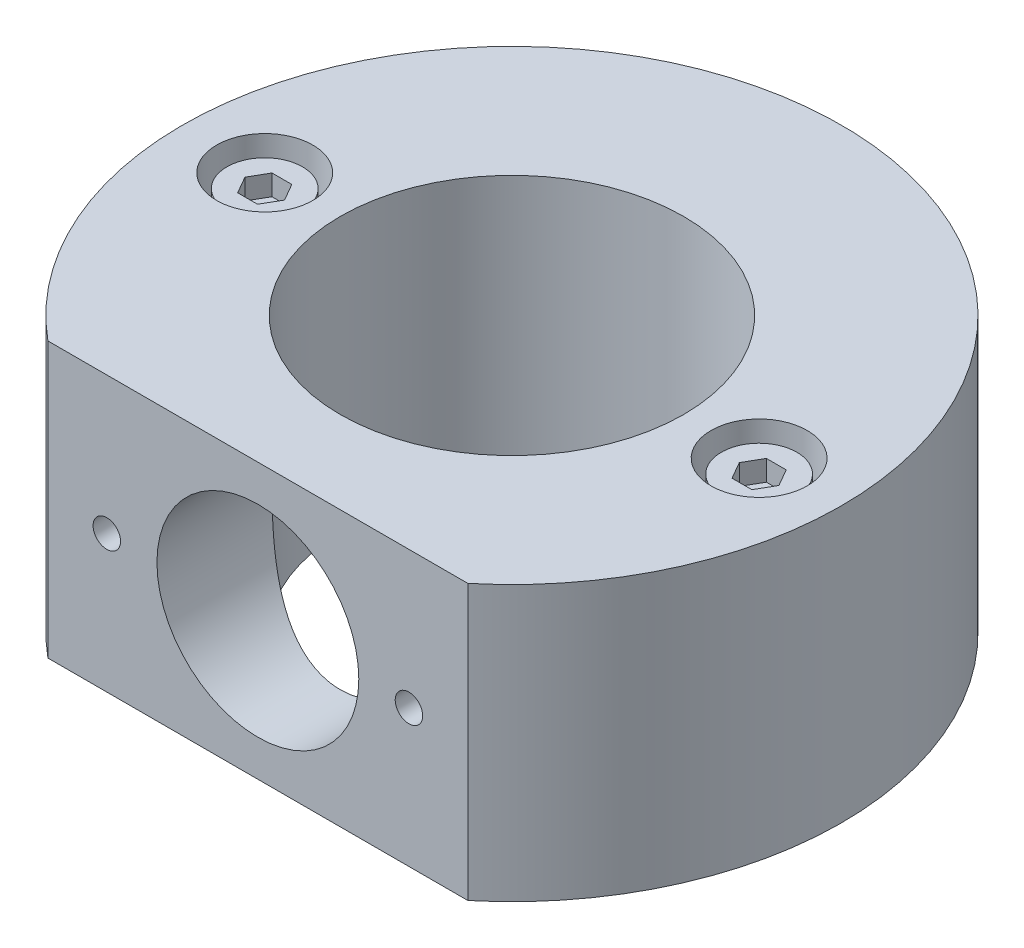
ISO-10303-21;
HEADER;
FILE_DESCRIPTION(('STEP AP214'),'2;1');
FILE_NAME('part.step','',(''),(''),'','','');
FILE_SCHEMA(('AUTOMOTIVE_DESIGN { 1 0 10303 214 1 1 1 1 }'));
ENDSEC;
DATA;
#1=APPLICATION_CONTEXT('core data for automotive mechanical design processes');
#2=APPLICATION_PROTOCOL_DEFINITION('international standard','automotive_design',2000,#1);
#3=PRODUCT_CONTEXT('',#1,'mechanical');
#4=PRODUCT('Part','Part','',(#3));
#5=PRODUCT_RELATED_PRODUCT_CATEGORY('part','',(#4));
#6=PRODUCT_DEFINITION_FORMATION('','',#4);
#7=PRODUCT_DEFINITION_CONTEXT('part definition',#1,'design');
#8=PRODUCT_DEFINITION('design','',#6,#7);
#9=PRODUCT_DEFINITION_SHAPE('','',#8);
#10=(LENGTH_UNIT() NAMED_UNIT(*) SI_UNIT(.MILLI.,.METRE.));
#11=(NAMED_UNIT(*) PLANE_ANGLE_UNIT() SI_UNIT($,.RADIAN.));
#12=(NAMED_UNIT(*) SI_UNIT($,.STERADIAN.) SOLID_ANGLE_UNIT());
#13=UNCERTAINTY_MEASURE_WITH_UNIT(LENGTH_MEASURE(1.E-05),#10,'distance_accuracy_value','');
#14=(GEOMETRIC_REPRESENTATION_CONTEXT(3) GLOBAL_UNCERTAINTY_ASSIGNED_CONTEXT((#13)) GLOBAL_UNIT_ASSIGNED_CONTEXT((#10,
#11,#12)) REPRESENTATION_CONTEXT('',''));
#15=CARTESIAN_POINT('',(0.,0.,0.));
#16=DIRECTION('',(0.,0.,1.));
#17=DIRECTION('',(1.,0.,0.));
#18=AXIS2_PLACEMENT_3D('',#15,#16,#17);
#19=CARTESIAN_POINT('',(-1.39659253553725E-13,20.,0.));
#20=DIRECTION('',(0.,-1.,0.));
#21=DIRECTION('',(1.,0.,0.));
#22=AXIS2_PLACEMENT_3D('',#19,#20,#21);
#23=CYLINDRICAL_SURFACE('',#22,12.5);
#24=CARTESIAN_POINT('',(0.,0.,0.));
#25=DIRECTION('',(0.,-1.,0.));
#26=DIRECTION('',(1.,0.,0.));
#27=AXIS2_PLACEMENT_3D('',#24,#25,#26);
#28=CIRCLE('',#27,12.5);
#29=CARTESIAN_POINT('',(12.5,0.,0.));
#30=VERTEX_POINT('',#29);
#31=EDGE_CURVE('E266',#30,#30,#28,.T.);
#32=ORIENTED_EDGE('',*,*,#31,.T.);
#33=EDGE_LOOP('',(#32));
#34=FACE_BOUND('',#33,.T.);
#35=CARTESIAN_POINT('',(0.,2.65000000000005,12.5));
#36=CARTESIAN_POINT('',(0.188687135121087,2.65000145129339,12.4999986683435));
#37=CARTESIAN_POINT('',(0.37743978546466,2.657277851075,12.4957163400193));
#38=CARTESIAN_POINT('',(0.753530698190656,2.68629332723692,12.4786886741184));
#39=CARTESIAN_POINT('',(0.940867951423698,2.70804188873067,12.4659377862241));
#40=CARTESIAN_POINT('',(1.31300012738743,2.76577214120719,12.4322565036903));
#41=CARTESIAN_POINT('',(1.49778885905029,2.80178373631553,12.4113089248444));
#42=CARTESIAN_POINT('',(1.8631561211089,2.88758913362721,12.3617419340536));
#43=CARTESIAN_POINT('',(2.04373280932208,2.9373888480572,12.333119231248));
#44=CARTESIAN_POINT('',(2.39847109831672,3.04987317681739,12.2690519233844));
#45=CARTESIAN_POINT('',(2.57266217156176,3.11248646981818,12.2336451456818));
#46=CARTESIAN_POINT('',(2.91470298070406,3.25010821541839,12.1566976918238));
#47=CARTESIAN_POINT('',(3.08255023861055,3.32512145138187,12.1151546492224));
#48=CARTESIAN_POINT('',(3.57501678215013,3.56762837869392,11.9826734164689));
#49=CARTESIAN_POINT('',(3.88903345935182,3.75274114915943,11.8837941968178));
#50=CARTESIAN_POINT('',(4.5054233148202,4.17978724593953,11.6647448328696));
#51=CARTESIAN_POINT('',(4.80517136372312,4.42493367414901,11.5435356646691));
#52=CARTESIAN_POINT('',(5.36201152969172,4.9581745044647,11.2956497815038));
#53=CARTESIAN_POINT('',(5.61904943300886,5.24632262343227,11.1689663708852));
#54=CARTESIAN_POINT('',(5.98273049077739,5.72496735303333,10.9762838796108));
#55=CARTESIAN_POINT('',(6.10569416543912,5.90245906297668,10.9081702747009));
#56=CARTESIAN_POINT('',(6.33616392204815,6.26873724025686,10.7759291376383));
#57=CARTESIAN_POINT('',(6.4436676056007,6.45752545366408,10.7118022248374));
#58=CARTESIAN_POINT('',(6.64209900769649,6.84525779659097,10.589904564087));
#59=CARTESIAN_POINT('',(6.7330479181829,7.04418851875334,10.5321257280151));
#60=CARTESIAN_POINT('',(6.89746900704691,7.45135797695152,10.4251882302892));
#61=CARTESIAN_POINT('',(6.97094737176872,7.65959338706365,10.3760265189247));
#62=CARTESIAN_POINT('',(7.0843561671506,8.03446871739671,10.2988077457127));
#63=CARTESIAN_POINT('',(7.12811421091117,8.19949640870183,10.2685022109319));
#64=CARTESIAN_POINT('',(7.20420972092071,8.53331967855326,10.2152594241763));
#65=CARTESIAN_POINT('',(7.2365496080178,8.70211445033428,10.1923206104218));
#66=CARTESIAN_POINT('',(7.28936834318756,9.04229079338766,10.1546130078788));
#67=CARTESIAN_POINT('',(7.30985864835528,9.21366970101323,10.1398363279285));
#68=CARTESIAN_POINT('',(7.33873028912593,9.55798094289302,10.1189603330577));
#69=CARTESIAN_POINT('',(7.34711140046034,9.73091330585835,10.1128611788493));
#70=CARTESIAN_POINT('',(7.35163767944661,10.0773171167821,10.1095713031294));
#71=CARTESIAN_POINT('',(7.34776210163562,10.2507889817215,10.1123956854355));
#72=CARTESIAN_POINT('',(7.32779047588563,10.5966521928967,10.1268769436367));
#73=CARTESIAN_POINT('',(7.31169437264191,10.7690435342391,10.138533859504));
#74=CARTESIAN_POINT('',(7.26751374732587,11.1115655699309,10.1702497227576));
#75=CARTESIAN_POINT('',(7.23942410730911,11.2816952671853,10.1903122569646));
#76=CARTESIAN_POINT('',(7.17162745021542,11.6185793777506,10.2381383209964));
#77=CARTESIAN_POINT('',(7.13191570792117,11.7853323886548,10.2659049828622));
#78=CARTESIAN_POINT('',(7.04177510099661,12.1129353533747,10.3279409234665));
#79=CARTESIAN_POINT('',(6.99144988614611,12.2738259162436,10.3621469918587));
#80=CARTESIAN_POINT('',(6.88035567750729,12.5906381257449,10.4362426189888));
#81=CARTESIAN_POINT('',(6.81958326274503,12.7465581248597,10.476134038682));
#82=CARTESIAN_POINT('',(6.62235706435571,13.2059159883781,10.6027737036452));
#83=CARTESIAN_POINT('',(6.47094919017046,13.5011134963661,10.6965197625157));
#84=CARTESIAN_POINT('',(6.10314538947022,14.1136916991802,10.9111915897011));
#85=CARTESIAN_POINT('',(5.88009380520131,14.4264068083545,11.0340342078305));
#86=CARTESIAN_POINT('',(5.51176820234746,14.8661642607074,11.2200472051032));
#87=CARTESIAN_POINT('',(5.38325760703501,15.0079609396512,11.2823911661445));
#88=CARTESIAN_POINT('',(5.11534440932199,15.2813225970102,11.4063583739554));
#89=CARTESIAN_POINT('',(4.97593991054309,15.4128857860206,11.4679814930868));
#90=CARTESIAN_POINT('',(4.66815520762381,15.6813487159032,11.5969667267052));
#91=CARTESIAN_POINT('',(4.49835426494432,15.8167586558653,11.6640476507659));
#92=CARTESIAN_POINT('',(4.14637317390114,16.0726773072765,11.7937588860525));
#93=CARTESIAN_POINT('',(3.96419797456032,16.1931919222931,11.8563909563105));
#94=CARTESIAN_POINT('',(3.58835823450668,16.4182669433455,11.9754972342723));
#95=CARTESIAN_POINT('',(3.39469559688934,16.5228299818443,12.0319724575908));
#96=CARTESIAN_POINT('',(2.99703717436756,16.7148341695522,12.1371349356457));
#97=CARTESIAN_POINT('',(2.793042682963,16.8022774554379,12.1858231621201));
#98=CARTESIAN_POINT('',(2.38996605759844,16.9536898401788,12.2710085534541));
#99=CARTESIAN_POINT('',(2.19144852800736,17.0188274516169,12.308098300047));
#100=CARTESIAN_POINT('',(1.78817440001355,17.1322361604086,12.3731213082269));
#101=CARTESIAN_POINT('',(1.58341800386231,17.1805078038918,12.4010548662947));
#102=CARTESIAN_POINT('',(1.16961672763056,17.2593952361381,12.4468987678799));
#103=CARTESIAN_POINT('',(0.960575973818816,17.290027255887,12.464818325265));
#104=CARTESIAN_POINT('',(0.540008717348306,17.3331818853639,12.4901059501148));
#105=CARTESIAN_POINT('',(0.328482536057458,17.3457068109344,12.4974753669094));
#106=CARTESIAN_POINT('',(-0.0674330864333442,17.3520006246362,12.5011766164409));
#107=CARTESIAN_POINT('',(-0.251779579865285,17.3479938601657,12.4988174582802));
#108=CARTESIAN_POINT('',(-0.619370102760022,17.3261704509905,12.4859998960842));
#109=CARTESIAN_POINT('',(-0.802614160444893,17.3083541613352,12.4755417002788));
#110=CARTESIAN_POINT('',(-1.16662778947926,17.2591468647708,12.4467793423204));
#111=CARTESIAN_POINT('',(-1.3473975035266,17.2277566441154,12.4284756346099));
#112=CARTESIAN_POINT('',(-1.70522100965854,17.1517955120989,12.3844548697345));
#113=CARTESIAN_POINT('',(-1.88227469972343,17.1072242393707,12.3587376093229));
#114=CARTESIAN_POINT('',(-2.22833866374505,17.0063461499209,12.3010042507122));
#115=CARTESIAN_POINT('',(-2.39743690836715,16.9502696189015,12.2691123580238));
#116=CARTESIAN_POINT('',(-2.73007749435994,16.8264715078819,12.1994101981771));
#117=CARTESIAN_POINT('',(-2.89361799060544,16.7587461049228,12.1615979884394));
#118=CARTESIAN_POINT('',(-3.37460731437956,16.5390061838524,12.0403933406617));
#119=CARTESIAN_POINT('',(-3.68267291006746,16.3703544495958,11.9491897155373));
#120=CARTESIAN_POINT('',(-4.29899241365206,15.9740528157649,11.7424565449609));
#121=CARTESIAN_POINT('',(-4.6039179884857,15.7420853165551,11.6253822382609));
#122=CARTESIAN_POINT('',(-5.17302246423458,15.2352292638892,11.3835602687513));
#123=CARTESIAN_POINT('',(-5.43715314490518,14.9602906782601,11.2588037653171));
#124=CARTESIAN_POINT('',(-5.81429221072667,14.5013539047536,11.0664942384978));
#125=CARTESIAN_POINT('',(-5.94280069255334,14.3303057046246,10.9978325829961));
#126=CARTESIAN_POINT('',(-6.18495531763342,13.9767716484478,10.8634924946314));
#127=CARTESIAN_POINT('',(-6.29859916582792,13.7942840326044,10.7978145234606));
#128=CARTESIAN_POINT('',(-6.51001451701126,13.4188578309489,10.6716851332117));
#129=CARTESIAN_POINT('',(-6.60780085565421,13.2259292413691,10.6112288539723));
#130=CARTESIAN_POINT('',(-6.78663914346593,12.8303878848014,10.4977497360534));
#131=CARTESIAN_POINT('',(-6.86769648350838,12.6277782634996,10.4447245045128));
#132=CARTESIAN_POINT('',(-6.99643516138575,12.2587422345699,10.358789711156));
#133=CARTESIAN_POINT('',(-7.0475442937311,12.0939408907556,10.324008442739));
#134=CARTESIAN_POINT('',(-7.13826833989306,11.7599817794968,10.2614893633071));
#135=CARTESIAN_POINT('',(-7.17789024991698,11.590826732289,10.2337472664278));
#136=CARTESIAN_POINT('',(-7.24515709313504,11.249191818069,10.1862357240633));
#137=CARTESIAN_POINT('',(-7.27281231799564,11.0767149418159,10.1664594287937));
#138=CARTESIAN_POINT('',(-7.31580523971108,10.7294516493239,10.1355660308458));
#139=CARTESIAN_POINT('',(-7.33114281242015,10.5546652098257,10.1244490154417));
#140=CARTESIAN_POINT('',(-7.3492890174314,10.2035706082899,10.1112847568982));
#141=CARTESIAN_POINT('',(-7.35205990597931,10.027259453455,10.109264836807));
#142=CARTESIAN_POINT('',(-7.34492513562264,9.67503148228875,10.1144497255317));
#143=CARTESIAN_POINT('',(-7.33501943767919,9.49911466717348,10.1216545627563));
#144=CARTESIAN_POINT('',(-7.30268112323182,9.14895253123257,10.1450107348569));
#145=CARTESIAN_POINT('',(-7.28024205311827,8.97470811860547,10.161166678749));
#146=CARTESIAN_POINT('',(-7.22316722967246,8.62922861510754,10.2018173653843));
#147=CARTESIAN_POINT('',(-7.18853134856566,8.45799355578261,10.226312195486));
#148=CARTESIAN_POINT('',(-7.10892963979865,8.12548105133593,10.2817987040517));
#149=CARTESIAN_POINT('',(-7.0643648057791,7.9640643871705,10.3125349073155));
#150=CARTESIAN_POINT('',(-6.9647630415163,7.64576797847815,10.3800621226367));
#151=CARTESIAN_POINT('',(-6.9097225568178,7.4888897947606,10.4168551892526));
#152=CARTESIAN_POINT('',(-6.7296317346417,7.02610005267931,10.5348318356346));
#153=CARTESIAN_POINT('',(-6.5895709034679,6.72786417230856,10.6236428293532));
#154=CARTESIAN_POINT('',(-6.24849643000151,6.11136647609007,10.8282753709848));
#155=CARTESIAN_POINT('',(-6.04140226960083,5.79715665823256,10.9461499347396));
#156=CARTESIAN_POINT('',(-5.69778432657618,5.35318958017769,11.1266392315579));
#157=CARTESIAN_POINT('',(-5.57765462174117,5.20966895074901,11.1874584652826));
#158=CARTESIAN_POINT('',(-5.32675106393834,4.93213970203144,11.3090731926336));
#159=CARTESIAN_POINT('',(-5.19597550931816,4.79813260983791,11.3698686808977));
#160=CARTESIAN_POINT('',(-4.904283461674,4.5212528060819,11.4990019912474));
#161=CARTESIAN_POINT('',(-4.74176190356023,4.37997159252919,11.5671351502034));
#162=CARTESIAN_POINT('',(-4.40410499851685,4.11163500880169,11.6998611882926));
#163=CARTESIAN_POINT('',(-4.22897380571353,3.98457498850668,11.7644552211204));
#164=CARTESIAN_POINT('',(-3.86674763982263,3.74557194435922,11.8884366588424));
#165=CARTESIAN_POINT('',(-3.67964507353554,3.633638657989,11.9478207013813));
#166=CARTESIAN_POINT('',(-3.29461831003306,3.42612756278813,12.0596708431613));
#167=CARTESIAN_POINT('',(-3.09669566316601,3.33054741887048,12.1121379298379));
#168=CARTESIAN_POINT('',(-2.70000728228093,3.16062863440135,12.206544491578));
#169=CARTESIAN_POINT('',(-2.50164144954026,3.08555502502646,12.2488388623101));
#170=CARTESIAN_POINT('',(-2.09762174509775,2.95246882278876,12.3244551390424));
#171=CARTESIAN_POINT('',(-1.89196925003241,2.89445302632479,12.3577787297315));
#172=CARTESIAN_POINT('',(-1.47575528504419,2.79651374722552,12.4143514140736));
#173=CARTESIAN_POINT('',(-1.26521176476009,2.75653257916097,12.4376326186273));
#174=CARTESIAN_POINT('',(-0.840662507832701,2.69508972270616,12.473515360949));
#175=CARTESIAN_POINT('',(-0.626659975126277,2.67361179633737,12.486126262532));
#176=CARTESIAN_POINT('',(-0.343464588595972,2.65770728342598,12.4954695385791));
#177=CARTESIAN_POINT('',(-0.27481817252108,2.65481810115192,12.4971674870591));
#178=CARTESIAN_POINT('',(-0.137450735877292,2.65096418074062,12.4994329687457));
#179=CARTESIAN_POINT('',(-0.0687297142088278,2.64999947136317,12.5000004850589));
#180=CARTESIAN_POINT('',(0.,2.65000000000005,12.5));
#181=B_SPLINE_CURVE_WITH_KNOTS('',3,(#35,#36,#37,#38,#39,#40,#41,#42,#43,#44,#45,#46,#47,#48,
#49,#50,#51,#52,#53,#54,#55,#56,#57,#58,#59,#60,#61,#62,#63,#64,#65,#66,#67,#68,#69,#70,#71,#72,
#73,#74,#75,#76,#77,#78,#79,#80,#81,#82,#83,#84,#85,#86,#87,#88,#89,#90,#91,#92,#93,#94,#95,#96,
#97,#98,#99,#100,#101,#102,#103,#104,#105,#106,#107,#108,#109,#110,#111,#112,#113,#114,#115,
#116,#117,#118,#119,#120,#121,#122,#123,#124,#125,#126,#127,#128,#129,#130,#131,#132,#133,#134,
#135,#136,#137,#138,#139,#140,#141,#142,#143,#144,#145,#146,#147,#148,#149,#150,#151,#152,#153,
#154,#155,#156,#157,#158,#159,#160,#161,#162,#163,#164,#165,#166,#167,#168,#169,#170,#171,#172,
#173,#174,#175,#176,#177,#178,#179,#180),.UNSPECIFIED.,.T.,.F.,(4,2,2,2,2,2,2,2,2,2,2,2,2,2,2,2,
2,2,2,2,2,2,2,2,2,2,2,2,2,2,2,2,2,2,2,2,2,2,2,2,2,2,2,2,2,2,2,2,2,2,2,2,2,2,2,2,2,2,2,2,2,2,2,2,
2,2,2,2,2,2,2,2,4),(0.,0.565987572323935,1.13234646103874,1.69989912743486,2.26769553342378,
2.83241354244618,3.39734990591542,4.52572664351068,5.73845320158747,6.95270755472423,
7.63124396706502,8.30988553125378,8.9876521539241,9.66517841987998,10.1848522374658,
10.7044158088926,11.2234761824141,11.7425461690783,12.2624951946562,12.7824465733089,
13.3026200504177,13.8230053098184,14.3385261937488,14.8542162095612,15.8850880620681,
17.0899566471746,17.6933100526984,18.2967687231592,18.9778384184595,19.6586373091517,
20.3393237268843,21.0199251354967,21.6556000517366,22.2912543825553,22.9263228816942,
23.5613101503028,24.1138419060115,24.6663594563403,25.2188450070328,25.7713457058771,
26.3137108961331,26.8562544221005,27.9405605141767,29.1379036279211,30.3366513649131,
31.0100553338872,31.6835631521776,32.356437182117,33.0290940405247,33.5566185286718,
34.0838210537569,34.6105692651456,35.1373227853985,35.6656573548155,36.1939935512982,
36.7226020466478,37.2512160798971,37.7614523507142,38.2718620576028,39.2921568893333,
40.4704691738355,41.0604398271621,41.6505049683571,42.3272900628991,43.00385320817,
43.6808498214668,44.3577496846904,45.0056305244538,45.6533896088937,46.2990618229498,
46.9441668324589,47.1503260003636,47.356488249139),.UNSPECIFIED.);
#182=CARTESIAN_POINT('',(0.,2.65000000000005,12.5));
#183=VERTEX_POINT('',#182);
#184=EDGE_CURVE('E19',#183,#183,#181,.T.);
#185=ORIENTED_EDGE('',*,*,#184,.T.);
#186=EDGE_LOOP('',(#185));
#187=FACE_BOUND('',#186,.T.);
#188=CARTESIAN_POINT('',(-1.39659253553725E-13,20.,0.));
#189=DIRECTION('',(0.,1.,0.));
#190=DIRECTION('',(-1.,0.,0.));
#191=AXIS2_PLACEMENT_3D('',#188,#189,#190);
#192=CIRCLE('',#191,12.5);
#193=CARTESIAN_POINT('',(-12.5000000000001,19.9999999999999,0.));
#194=VERTEX_POINT('',#193);
#195=EDGE_CURVE('E288',#194,#194,#192,.T.);
#196=ORIENTED_EDGE('',*,*,#195,.T.);
#197=EDGE_LOOP('',(#196));
#198=FACE_BOUND('',#197,.T.);
#199=ADVANCED_FACE('F15',(#34,#187,#198),#23,.F.);
#200=CARTESIAN_POINT('',(-1.39659253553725E-13,20.,0.));
#201=DIRECTION('',(0.,1.,0.));
#202=DIRECTION('',(-1.,0.,0.));
#203=AXIS2_PLACEMENT_3D('',#200,#201,#202);
#204=PLANE('',#203);
#205=CARTESIAN_POINT('',(18.,20.,0.));
#206=DIRECTION('',(0.,1.,0.));
#207=DIRECTION('',(-1.,0.,0.));
#208=AXIS2_PLACEMENT_3D('',#205,#206,#207);
#209=CIRCLE('',#208,3.5);
#210=CARTESIAN_POINT('',(14.5,20.,0.));
#211=VERTEX_POINT('',#210);
#212=EDGE_CURVE('E291',#211,#211,#209,.T.);
#213=ORIENTED_EDGE('',*,*,#212,.F.);
#214=EDGE_LOOP('',(#213));
#215=FACE_BOUND('',#214,.T.);
#216=ORIENTED_EDGE('',*,*,#195,.F.);
#217=EDGE_LOOP('',(#216));
#218=FACE_BOUND('',#217,.T.);
#219=CARTESIAN_POINT('',(-18.,20.,0.));
#220=DIRECTION('',(0.,1.,0.));
#221=DIRECTION('',(-1.,0.,0.));
#222=AXIS2_PLACEMENT_3D('',#219,#220,#221);
#223=CIRCLE('',#222,3.5);
#224=CARTESIAN_POINT('',(-21.5,20.,0.));
#225=VERTEX_POINT('',#224);
#226=EDGE_CURVE('E285',#225,#225,#223,.T.);
#227=ORIENTED_EDGE('',*,*,#226,.F.);
#228=EDGE_LOOP('',(#227));
#229=FACE_BOUND('',#228,.T.);
#230=DIRECTION('',(-1.,0.,0.));
#231=VECTOR('',#230,1.);
#232=CARTESIAN_POINT('',(-1.39659253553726E-13,20.,18.5));
#233=LINE('',#232,#231);
#234=CARTESIAN_POINT('',(15.2888848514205,20.,18.5));
#235=VERTEX_POINT('',#234);
#236=CARTESIAN_POINT('',(-15.2888848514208,20.,18.5));
#237=VERTEX_POINT('',#236);
#238=EDGE_CURVE('E280',#235,#237,#233,.T.);
#239=ORIENTED_EDGE('',*,*,#238,.F.);
#240=CARTESIAN_POINT('',(-1.39659253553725E-13,20.,0.));
#241=DIRECTION('',(0.,1.,0.));
#242=DIRECTION('',(-1.,0.,0.));
#243=AXIS2_PLACEMENT_3D('',#240,#241,#242);
#244=CIRCLE('',#243,24.);
#245=EDGE_CURVE('E282',#235,#237,#244,.T.);
#246=ORIENTED_EDGE('',*,*,#245,.T.);
#247=EDGE_LOOP('',(#239,#246));
#248=FACE_BOUND('',#247,.T.);
#249=ADVANCED_FACE('F322',(#215,#218,#229,#248),#204,.T.);
#250=CARTESIAN_POINT('',(0.,0.,0.));
#251=DIRECTION('',(0.,1.,0.));
#252=DIRECTION('',(-1.,0.,0.));
#253=AXIS2_PLACEMENT_3D('',#250,#251,#252);
#254=PLANE('',#253);
#255=DIRECTION('',(1.,0.,0.));
#256=VECTOR('',#255,1.);
#257=CARTESIAN_POINT('',(0.,0.,18.5));
#258=LINE('',#257,#256);
#259=CARTESIAN_POINT('',(-15.2888848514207,0.,18.5));
#260=VERTEX_POINT('',#259);
#261=CARTESIAN_POINT('',(15.2888848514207,1.71354117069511E-13,18.5));
#262=VERTEX_POINT('',#261);
#263=EDGE_CURVE('E275',#260,#262,#258,.T.);
#264=ORIENTED_EDGE('',*,*,#263,.F.);
#265=CARTESIAN_POINT('',(0.,0.,0.));
#266=DIRECTION('',(0.,-1.,0.));
#267=DIRECTION('',(1.,0.,0.));
#268=AXIS2_PLACEMENT_3D('',#265,#266,#267);
#269=CIRCLE('',#268,24.);
#270=EDGE_CURVE('E277',#260,#262,#269,.T.);
#271=ORIENTED_EDGE('',*,*,#270,.T.);
#272=EDGE_LOOP('',(#264,#271));
#273=FACE_BOUND('',#272,.T.);
#274=CARTESIAN_POINT('',(-18.,-1.25693328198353E-13,0.));
#275=DIRECTION('',(0.,-1.,0.));
#276=DIRECTION('',(1.,0.,0.));
#277=AXIS2_PLACEMENT_3D('',#274,#275,#276);
#278=CIRCLE('',#277,1.75);
#279=CARTESIAN_POINT('',(-16.25,-1.13473143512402E-13,0.));
#280=VERTEX_POINT('',#279);
#281=EDGE_CURVE('E272',#280,#280,#278,.T.);
#282=ORIENTED_EDGE('',*,*,#281,.F.);
#283=EDGE_LOOP('',(#282));
#284=FACE_BOUND('',#283,.T.);
#285=CARTESIAN_POINT('',(18.,1.25693328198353E-13,0.));
#286=DIRECTION('',(0.,-1.,0.));
#287=DIRECTION('',(1.,0.,0.));
#288=AXIS2_PLACEMENT_3D('',#285,#286,#287);
#289=CIRCLE('',#288,1.75);
#290=CARTESIAN_POINT('',(19.75,1.37913512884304E-13,0.));
#291=VERTEX_POINT('',#290);
#292=EDGE_CURVE('E269',#291,#291,#289,.T.);
#293=ORIENTED_EDGE('',*,*,#292,.F.);
#294=EDGE_LOOP('',(#293));
#295=FACE_BOUND('',#294,.T.);
#296=ORIENTED_EDGE('',*,*,#31,.F.);
#297=EDGE_LOOP('',(#296));
#298=FACE_BOUND('',#297,.T.);
#299=ADVANCED_FACE('F328',(#273,#284,#295,#298),#254,.F.);
#300=CARTESIAN_POINT('',(-1.39659253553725E-13,20.,0.));
#301=DIRECTION('',(0.,-1.,0.));
#302=DIRECTION('',(1.,0.,0.));
#303=AXIS2_PLACEMENT_3D('',#300,#301,#302);
#304=CYLINDRICAL_SURFACE('',#303,24.);
#305=ORIENTED_EDGE('',*,*,#270,.F.);
#306=DIRECTION('',(0.,-1.,0.));
#307=VECTOR('',#306,1.);
#308=CARTESIAN_POINT('',(-15.2888848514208,20.,18.5));
#309=LINE('',#308,#307);
#310=EDGE_CURVE('E10',#237,#260,#309,.T.);
#311=ORIENTED_EDGE('',*,*,#310,.F.);
#312=ORIENTED_EDGE('',*,*,#245,.F.);
#313=DIRECTION('',(0.,-1.,0.));
#314=VECTOR('',#313,1.);
#315=CARTESIAN_POINT('',(15.2888848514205,20.,18.5));
#316=LINE('',#315,#314);
#317=EDGE_CURVE('E29',#235,#262,#316,.T.);
#318=ORIENTED_EDGE('',*,*,#317,.T.);
#319=EDGE_LOOP('',(#305,#311,#312,#318));
#320=FACE_BOUND('',#319,.T.);
#321=ADVANCED_FACE('F17',(#320),#304,.T.);
#322=CARTESIAN_POINT('',(15.2888848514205,20.,18.5));
#323=DIRECTION('',(0.,0.,-1.));
#324=DIRECTION('',(0.,-1.,0.));
#325=AXIS2_PLACEMENT_3D('',#322,#323,#324);
#326=PLANE('',#325);
#327=CARTESIAN_POINT('',(-11.,10.,18.5));
#328=DIRECTION('',(0.,0.,1.));
#329=DIRECTION('',(0.,1.,0.));
#330=AXIS2_PLACEMENT_3D('',#327,#328,#329);
#331=CIRCLE('',#330,1.);
#332=CARTESIAN_POINT('',(-11.,11.,18.5));
#333=VERTEX_POINT('',#332);
#334=EDGE_CURVE('E251',#333,#333,#331,.T.);
#335=ORIENTED_EDGE('',*,*,#334,.F.);
#336=EDGE_LOOP('',(#335));
#337=FACE_BOUND('',#336,.T.);
#338=CARTESIAN_POINT('',(11.,10.0000000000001,18.5));
#339=DIRECTION('',(0.,0.,1.));
#340=DIRECTION('',(0.,1.,0.));
#341=AXIS2_PLACEMENT_3D('',#338,#339,#340);
#342=CIRCLE('',#341,1.);
#343=CARTESIAN_POINT('',(11.,11.0000000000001,18.5));
#344=VERTEX_POINT('',#343);
#345=EDGE_CURVE('E255',#344,#344,#342,.T.);
#346=ORIENTED_EDGE('',*,*,#345,.F.);
#347=EDGE_LOOP('',(#346));
#348=FACE_BOUND('',#347,.T.);
#349=ORIENTED_EDGE('',*,*,#263,.T.);
#350=ORIENTED_EDGE('',*,*,#317,.F.);
#351=ORIENTED_EDGE('',*,*,#238,.T.);
#352=ORIENTED_EDGE('',*,*,#310,.T.);
#353=EDGE_LOOP('',(#349,#350,#351,#352));
#354=FACE_BOUND('',#353,.T.);
#355=CARTESIAN_POINT('',(0.,10.,18.5));
#356=DIRECTION('',(0.,0.,1.));
#357=DIRECTION('',(0.,1.,0.));
#358=AXIS2_PLACEMENT_3D('',#355,#356,#357);
#359=CIRCLE('',#358,7.35);
#360=CARTESIAN_POINT('',(-1.21154402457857E-13,17.35,18.5));
#361=VERTEX_POINT('',#360);
#362=EDGE_CURVE('E261',#361,#361,#359,.T.);
#363=ORIENTED_EDGE('',*,*,#362,.F.);
#364=EDGE_LOOP('',(#363));
#365=FACE_BOUND('',#364,.T.);
#366=ADVANCED_FACE('F308',(#337,#348,#354,#365),#326,.F.);
#367=CARTESIAN_POINT('',(0.,10.,18.5));
#368=DIRECTION('',(0.,0.,-1.));
#369=DIRECTION('',(0.,-1.,0.));
#370=AXIS2_PLACEMENT_3D('',#367,#368,#369);
#371=CYLINDRICAL_SURFACE('',#370,7.35);
#372=ORIENTED_EDGE('',*,*,#362,.T.);
#373=EDGE_LOOP('',(#372));
#374=FACE_BOUND('',#373,.T.);
#375=ORIENTED_EDGE('',*,*,#184,.F.);
#376=EDGE_LOOP('',(#375));
#377=FACE_BOUND('',#376,.T.);
#378=ADVANCED_FACE('F305',(#374,#377),#371,.F.);
#379=CARTESIAN_POINT('',(18.,20.,0.));
#380=DIRECTION('',(0.,1.,0.));
#381=DIRECTION('',(-1.,0.,0.));
#382=AXIS2_PLACEMENT_3D('',#379,#380,#381);
#383=CYLINDRICAL_SURFACE('',#382,1.75);
#384=CARTESIAN_POINT('',(18.,16.,0.));
#385=DIRECTION('',(0.,-1.,0.));
#386=DIRECTION('',(1.,0.,0.));
#387=AXIS2_PLACEMENT_3D('',#384,#385,#386);
#388=CIRCLE('',#387,1.75);
#389=CARTESIAN_POINT('',(19.75,16.,0.));
#390=VERTEX_POINT('',#389);
#391=EDGE_CURVE('E248',#390,#390,#388,.F.);
#392=ORIENTED_EDGE('',*,*,#391,.T.);
#393=EDGE_LOOP('',(#392));
#394=FACE_BOUND('',#393,.T.);
#395=ORIENTED_EDGE('',*,*,#292,.T.);
#396=EDGE_LOOP('',(#395));
#397=FACE_BOUND('',#396,.T.);
#398=ADVANCED_FACE('F307',(#394,#397),#383,.F.);
#399=CARTESIAN_POINT('',(14.5,16.,0.));
#400=DIRECTION('',(0.,-1.,0.));
#401=DIRECTION('',(1.,0.,0.));
#402=AXIS2_PLACEMENT_3D('',#399,#400,#401);
#403=PLANE('',#402);
#404=CARTESIAN_POINT('',(18.,16.,0.));
#405=DIRECTION('',(0.,1.,0.));
#406=DIRECTION('',(-0.866025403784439,0.,-0.5));
#407=AXIS2_PLACEMENT_3D('',#404,#405,#406);
#408=CIRCLE('',#407,2.75);
#409=CARTESIAN_POINT('',(15.6184301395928,16.,-1.37500000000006));
#410=VERTEX_POINT('',#409);
#411=EDGE_CURVE('E236',#410,#410,#408,.T.);
#412=ORIENTED_EDGE('',*,*,#411,.F.);
#413=EDGE_LOOP('',(#412));
#414=FACE_BOUND('',#413,.T.);
#415=CARTESIAN_POINT('',(18.,16.,0.));
#416=DIRECTION('',(0.,1.,0.));
#417=DIRECTION('',(-1.,0.,0.));
#418=AXIS2_PLACEMENT_3D('',#415,#416,#417);
#419=CIRCLE('',#418,3.5);
#420=CARTESIAN_POINT('',(14.5,16.,0.));
#421=VERTEX_POINT('',#420);
#422=EDGE_CURVE('E297',#421,#421,#419,.T.);
#423=ORIENTED_EDGE('',*,*,#422,.T.);
#424=EDGE_LOOP('',(#423));
#425=FACE_BOUND('',#424,.T.);
#426=ADVANCED_FACE('F316',(#414,#425),#403,.F.);
#427=CARTESIAN_POINT('',(18.,20.,0.));
#428=DIRECTION('',(0.,1.,0.));
#429=DIRECTION('',(-1.,0.,0.));
#430=AXIS2_PLACEMENT_3D('',#427,#428,#429);
#431=CYLINDRICAL_SURFACE('',#430,3.5);
#432=ORIENTED_EDGE('',*,*,#212,.T.);
#433=EDGE_LOOP('',(#432));
#434=FACE_BOUND('',#433,.T.);
#435=ORIENTED_EDGE('',*,*,#422,.F.);
#436=EDGE_LOOP('',(#435));
#437=FACE_BOUND('',#436,.T.);
#438=ADVANCED_FACE('F351',(#434,#437),#431,.F.);
#439=CARTESIAN_POINT('',(-18.,20.,0.));
#440=DIRECTION('',(0.,1.,0.));
#441=DIRECTION('',(-1.,0.,0.));
#442=AXIS2_PLACEMENT_3D('',#439,#440,#441);
#443=CYLINDRICAL_SURFACE('',#442,1.75);
#444=CARTESIAN_POINT('',(-18.,16.,0.));
#445=DIRECTION('',(0.,-1.,0.));
#446=DIRECTION('',(1.,0.,0.));
#447=AXIS2_PLACEMENT_3D('',#444,#445,#446);
#448=CIRCLE('',#447,1.75);
#449=CARTESIAN_POINT('',(-16.25,16.,0.));
#450=VERTEX_POINT('',#449);
#451=EDGE_CURVE('E184',#450,#450,#448,.F.);
#452=ORIENTED_EDGE('',*,*,#451,.T.);
#453=EDGE_LOOP('',(#452));
#454=FACE_BOUND('',#453,.T.);
#455=ORIENTED_EDGE('',*,*,#281,.T.);
#456=EDGE_LOOP('',(#455));
#457=FACE_BOUND('',#456,.T.);
#458=ADVANCED_FACE('F348',(#454,#457),#443,.F.);
#459=CARTESIAN_POINT('',(-21.5,16.,0.));
#460=DIRECTION('',(0.,-1.,0.));
#461=DIRECTION('',(1.,0.,0.));
#462=AXIS2_PLACEMENT_3D('',#459,#460,#461);
#463=PLANE('',#462);
#464=CARTESIAN_POINT('',(-18.,16.,0.));
#465=DIRECTION('',(0.,1.,0.));
#466=DIRECTION('',(-0.866025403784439,0.,-0.5));
#467=AXIS2_PLACEMENT_3D('',#464,#465,#466);
#468=CIRCLE('',#467,2.75);
#469=CARTESIAN_POINT('',(-20.3815698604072,16.,-1.37500000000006));
#470=VERTEX_POINT('',#469);
#471=EDGE_CURVE('E130',#470,#470,#468,.T.);
#472=ORIENTED_EDGE('',*,*,#471,.F.);
#473=EDGE_LOOP('',(#472));
#474=FACE_BOUND('',#473,.T.);
#475=CARTESIAN_POINT('',(-18.,16.,0.));
#476=DIRECTION('',(0.,1.,0.));
#477=DIRECTION('',(-1.,0.,0.));
#478=AXIS2_PLACEMENT_3D('',#475,#476,#477);
#479=CIRCLE('',#478,3.5);
#480=CARTESIAN_POINT('',(-21.5,16.,0.));
#481=VERTEX_POINT('',#480);
#482=EDGE_CURVE('E294',#481,#481,#479,.T.);
#483=ORIENTED_EDGE('',*,*,#482,.T.);
#484=EDGE_LOOP('',(#483));
#485=FACE_BOUND('',#484,.T.);
#486=ADVANCED_FACE('F350',(#474,#485),#463,.F.);
#487=CARTESIAN_POINT('',(-18.,20.,0.));
#488=DIRECTION('',(0.,1.,0.));
#489=DIRECTION('',(-1.,0.,0.));
#490=AXIS2_PLACEMENT_3D('',#487,#488,#489);
#491=CYLINDRICAL_SURFACE('',#490,3.5);
#492=ORIENTED_EDGE('',*,*,#226,.T.);
#493=EDGE_LOOP('',(#492));
#494=FACE_BOUND('',#493,.T.);
#495=ORIENTED_EDGE('',*,*,#482,.F.);
#496=EDGE_LOOP('',(#495));
#497=FACE_BOUND('',#496,.T.);
#498=ADVANCED_FACE('F359',(#494,#497),#491,.F.);
#499=CARTESIAN_POINT('',(11.,10.0000000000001,14.5));
#500=DIRECTION('',(0.,0.,1.));
#501=DIRECTION('',(0.,1.,0.));
#502=AXIS2_PLACEMENT_3D('',#499,#500,#501);
#503=PLANE('',#502);
#504=CARTESIAN_POINT('',(11.,10.0000000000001,14.5));
#505=DIRECTION('',(0.,0.,1.));
#506=DIRECTION('',(0.,1.,0.));
#507=AXIS2_PLACEMENT_3D('',#504,#505,#506);
#508=CIRCLE('',#507,1.);
#509=CARTESIAN_POINT('',(11.,11.0000000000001,14.5));
#510=VERTEX_POINT('',#509);
#511=EDGE_CURVE('E258',#510,#510,#508,.T.);
#512=ORIENTED_EDGE('',*,*,#511,.T.);
#513=EDGE_LOOP('',(#512));
#514=FACE_BOUND('',#513,.T.);
#515=ADVANCED_FACE('F448',(#514),#503,.T.);
#516=CARTESIAN_POINT('',(11.,10.0000000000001,14.5));
#517=DIRECTION('',(0.,0.,1.));
#518=DIRECTION('',(0.,1.,0.));
#519=AXIS2_PLACEMENT_3D('',#516,#517,#518);
#520=CYLINDRICAL_SURFACE('',#519,1.);
#521=ORIENTED_EDGE('',*,*,#511,.F.);
#522=EDGE_LOOP('',(#521));
#523=FACE_BOUND('',#522,.T.);
#524=ORIENTED_EDGE('',*,*,#345,.T.);
#525=EDGE_LOOP('',(#524));
#526=FACE_BOUND('',#525,.T.);
#527=ADVANCED_FACE('F443',(#523,#526),#520,.F.);
#528=CARTESIAN_POINT('',(-11.,10.,14.5));
#529=DIRECTION('',(0.,0.,1.));
#530=DIRECTION('',(0.,1.,0.));
#531=AXIS2_PLACEMENT_3D('',#528,#529,#530);
#532=PLANE('',#531);
#533=CARTESIAN_POINT('',(-11.,10.,14.5));
#534=DIRECTION('',(0.,0.,1.));
#535=DIRECTION('',(0.,1.,0.));
#536=AXIS2_PLACEMENT_3D('',#533,#534,#535);
#537=CIRCLE('',#536,1.);
#538=CARTESIAN_POINT('',(-11.,11.,14.5));
#539=VERTEX_POINT('',#538);
#540=EDGE_CURVE('E252',#539,#539,#537,.T.);
#541=ORIENTED_EDGE('',*,*,#540,.T.);
#542=EDGE_LOOP('',(#541));
#543=FACE_BOUND('',#542,.T.);
#544=ADVANCED_FACE('F440',(#543),#532,.T.);
#545=CARTESIAN_POINT('',(-11.,10.,14.5));
#546=DIRECTION('',(0.,0.,1.));
#547=DIRECTION('',(0.,1.,0.));
#548=AXIS2_PLACEMENT_3D('',#545,#546,#547);
#549=CYLINDRICAL_SURFACE('',#548,1.);
#550=ORIENTED_EDGE('',*,*,#540,.F.);
#551=EDGE_LOOP('',(#550));
#552=FACE_BOUND('',#551,.T.);
#553=ORIENTED_EDGE('',*,*,#334,.T.);
#554=EDGE_LOOP('',(#553));
#555=FACE_BOUND('',#554,.T.);
#556=ADVANCED_FACE('F380',(#552,#555),#549,.F.);
#557=CARTESIAN_POINT('',(18.,16.,0.));
#558=DIRECTION('',(0.,1.,0.));
#559=DIRECTION('',(-0.866025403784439,0.,-0.5));
#560=AXIS2_PLACEMENT_3D('',#557,#558,#559);
#561=CYLINDRICAL_SURFACE('',#560,2.75);
#562=ORIENTED_EDGE('',*,*,#411,.T.);
#563=EDGE_LOOP('',(#562));
#564=FACE_BOUND('',#563,.T.);
#565=CARTESIAN_POINT('',(18.,19.,0.));
#566=DIRECTION('',(0.,1.,0.));
#567=DIRECTION('',(-0.866025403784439,0.,-0.5));
#568=AXIS2_PLACEMENT_3D('',#565,#566,#567);
#569=CIRCLE('',#568,2.75);
#570=CARTESIAN_POINT('',(15.6184301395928,19.,-1.37500000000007));
#571=VERTEX_POINT('',#570);
#572=EDGE_CURVE('E239',#571,#571,#569,.T.);
#573=ORIENTED_EDGE('',*,*,#572,.F.);
#574=EDGE_LOOP('',(#573));
#575=FACE_BOUND('',#574,.T.);
#576=ADVANCED_FACE('F376',(#564,#575),#561,.T.);
#577=CARTESIAN_POINT('',(18.,19.,0.));
#578=DIRECTION('',(0.,1.,0.));
#579=DIRECTION('',(-0.866025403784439,0.,-0.5));
#580=AXIS2_PLACEMENT_3D('',#577,#578,#579);
#581=PLANE('',#580);
#582=ORIENTED_EDGE('',*,*,#572,.T.);
#583=EDGE_LOOP('',(#582));
#584=FACE_BOUND('',#583,.T.);
#585=DIRECTION('',(1.,0.,0.));
#586=VECTOR('',#585,1.);
#587=CARTESIAN_POINT('',(17.2783121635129,19.,1.24999999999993));
#588=LINE('',#587,#586);
#589=CARTESIAN_POINT('',(17.2783121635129,19.,1.24999999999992));
#590=VERTEX_POINT('',#589);
#591=CARTESIAN_POINT('',(18.7216878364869,19.,1.24999999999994));
#592=VERTEX_POINT('',#591);
#593=EDGE_CURVE('E188',#590,#592,#588,.T.);
#594=ORIENTED_EDGE('',*,*,#593,.F.);
#595=DIRECTION('',(-0.5,0.,-0.866025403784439));
#596=VECTOR('',#595,1.);
#597=CARTESIAN_POINT('',(17.2783121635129,19.,1.24999999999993));
#598=LINE('',#597,#596);
#599=CARTESIAN_POINT('',(16.5566243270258,19.,0.));
#600=VERTEX_POINT('',#599);
#601=EDGE_CURVE('E187',#590,#600,#598,.T.);
#602=ORIENTED_EDGE('',*,*,#601,.T.);
#603=DIRECTION('',(-0.5,0.,0.866025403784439));
#604=VECTOR('',#603,1.);
#605=CARTESIAN_POINT('',(17.2783121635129,19.,-1.25000000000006));
#606=LINE('',#605,#604);
#607=CARTESIAN_POINT('',(17.2783121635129,19.,-1.25000000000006));
#608=VERTEX_POINT('',#607);
#609=EDGE_CURVE('E201',#608,#600,#606,.T.);
#610=ORIENTED_EDGE('',*,*,#609,.F.);
#611=DIRECTION('',(-1.,0.,0.));
#612=VECTOR('',#611,1.);
#613=CARTESIAN_POINT('',(18.7216878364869,19.,-1.25000000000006));
#614=LINE('',#613,#612);
#615=CARTESIAN_POINT('',(18.7216878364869,19.,-1.25000000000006));
#616=VERTEX_POINT('',#615);
#617=EDGE_CURVE('E198',#616,#608,#614,.T.);
#618=ORIENTED_EDGE('',*,*,#617,.F.);
#619=DIRECTION('',(0.5,0.,0.866025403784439));
#620=VECTOR('',#619,1.);
#621=CARTESIAN_POINT('',(18.7216878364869,19.,-1.25000000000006));
#622=LINE('',#621,#620);
#623=CARTESIAN_POINT('',(19.4433756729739,19.,0.));
#624=VERTEX_POINT('',#623);
#625=EDGE_CURVE('E195',#616,#624,#622,.T.);
#626=ORIENTED_EDGE('',*,*,#625,.T.);
#627=DIRECTION('',(0.5,0.,-0.866025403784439));
#628=VECTOR('',#627,1.);
#629=CARTESIAN_POINT('',(18.7216878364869,19.,1.24999999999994));
#630=LINE('',#629,#628);
#631=EDGE_CURVE('E192',#592,#624,#630,.T.);
#632=ORIENTED_EDGE('',*,*,#631,.F.);
#633=EDGE_LOOP('',(#594,#602,#610,#618,#626,#632));
#634=FACE_BOUND('',#633,.T.);
#635=ADVANCED_FACE('F379',(#584,#634),#581,.T.);
#636=CARTESIAN_POINT('',(16.5566243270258,17.5,0.));
#637=DIRECTION('',(0.,1.,0.));
#638=DIRECTION('',(-0.866025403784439,0.,-0.5));
#639=AXIS2_PLACEMENT_3D('',#636,#637,#638);
#640=PLANE('',#639);
#641=DIRECTION('',(-0.5,0.,-0.866025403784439));
#642=VECTOR('',#641,1.);
#643=CARTESIAN_POINT('',(17.2783121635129,17.5,1.24999999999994));
#644=LINE('',#643,#642);
#645=CARTESIAN_POINT('',(17.2783121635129,17.5,1.24999999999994));
#646=VERTEX_POINT('',#645);
#647=CARTESIAN_POINT('',(16.5566243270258,17.5,0.));
#648=VERTEX_POINT('',#647);
#649=EDGE_CURVE('E191',#646,#648,#644,.T.);
#650=ORIENTED_EDGE('',*,*,#649,.F.);
#651=DIRECTION('',(1.,0.,0.));
#652=VECTOR('',#651,1.);
#653=CARTESIAN_POINT('',(17.2783121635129,17.5,1.24999999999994));
#654=LINE('',#653,#652);
#655=CARTESIAN_POINT('',(18.7216878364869,17.5,1.24999999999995));
#656=VERTEX_POINT('',#655);
#657=EDGE_CURVE('E206',#646,#656,#654,.T.);
#658=ORIENTED_EDGE('',*,*,#657,.T.);
#659=DIRECTION('',(0.5,0.,-0.866025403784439));
#660=VECTOR('',#659,1.);
#661=CARTESIAN_POINT('',(18.7216878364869,17.5,1.24999999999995));
#662=LINE('',#661,#660);
#663=CARTESIAN_POINT('',(19.4433756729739,17.5,0.));
#664=VERTEX_POINT('',#663);
#665=EDGE_CURVE('E210',#656,#664,#662,.T.);
#666=ORIENTED_EDGE('',*,*,#665,.T.);
#667=DIRECTION('',(0.5,0.,0.866025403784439));
#668=VECTOR('',#667,1.);
#669=CARTESIAN_POINT('',(18.7216878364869,17.5,-1.25000000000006));
#670=LINE('',#669,#668);
#671=CARTESIAN_POINT('',(18.7216878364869,17.5,-1.25000000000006));
#672=VERTEX_POINT('',#671);
#673=EDGE_CURVE('E213',#672,#664,#670,.T.);
#674=ORIENTED_EDGE('',*,*,#673,.F.);
#675=DIRECTION('',(-1.,0.,0.));
#676=VECTOR('',#675,1.);
#677=CARTESIAN_POINT('',(18.7216878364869,17.5,-1.25000000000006));
#678=LINE('',#677,#676);
#679=CARTESIAN_POINT('',(17.2783121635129,17.5,-1.25000000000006));
#680=VERTEX_POINT('',#679);
#681=EDGE_CURVE('E216',#672,#680,#678,.T.);
#682=ORIENTED_EDGE('',*,*,#681,.T.);
#683=DIRECTION('',(-0.5,0.,0.866025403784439));
#684=VECTOR('',#683,1.);
#685=CARTESIAN_POINT('',(17.2783121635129,17.5,-1.25000000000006));
#686=LINE('',#685,#684);
#687=EDGE_CURVE('E219',#680,#648,#686,.T.);
#688=ORIENTED_EDGE('',*,*,#687,.T.);
#689=EDGE_LOOP('',(#650,#658,#666,#674,#682,#688));
#690=FACE_BOUND('',#689,.T.);
#691=ADVANCED_FACE('F386',(#690),#640,.T.);
#692=CARTESIAN_POINT('',(17.2783121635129,17.5,1.24999999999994));
#693=DIRECTION('',(0.,0.,1.));
#694=DIRECTION('',(1.,0.,0.));
#695=AXIS2_PLACEMENT_3D('',#692,#693,#694);
#696=PLANE('',#695);
#697=ORIENTED_EDGE('',*,*,#657,.F.);
#698=DIRECTION('',(0.,1.,0.));
#699=VECTOR('',#698,1.);
#700=CARTESIAN_POINT('',(17.2783121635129,17.5,1.24999999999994));
#701=LINE('',#700,#699);
#702=EDGE_CURVE('E209',#646,#590,#701,.T.);
#703=ORIENTED_EDGE('',*,*,#702,.T.);
#704=ORIENTED_EDGE('',*,*,#593,.T.);
#705=DIRECTION('',(0.,1.,0.));
#706=VECTOR('',#705,1.);
#707=CARTESIAN_POINT('',(18.7216878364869,17.5,1.24999999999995));
#708=LINE('',#707,#706);
#709=EDGE_CURVE('E226',#656,#592,#708,.T.);
#710=ORIENTED_EDGE('',*,*,#709,.F.);
#711=EDGE_LOOP('',(#697,#703,#704,#710));
#712=FACE_BOUND('',#711,.T.);
#713=ADVANCED_FACE('F393',(#712),#696,.F.);
#714=CARTESIAN_POINT('',(18.7216878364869,17.5,1.24999999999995));
#715=DIRECTION('',(0.866025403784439,0.,0.5));
#716=DIRECTION('',(0.5,0.,-0.866025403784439));
#717=AXIS2_PLACEMENT_3D('',#714,#715,#716);
#718=PLANE('',#717);
#719=ORIENTED_EDGE('',*,*,#709,.T.);
#720=ORIENTED_EDGE('',*,*,#631,.T.);
#721=DIRECTION('',(0.,1.,0.));
#722=VECTOR('',#721,1.);
#723=CARTESIAN_POINT('',(19.4433756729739,17.5,0.));
#724=LINE('',#723,#722);
#725=EDGE_CURVE('E228',#664,#624,#724,.T.);
#726=ORIENTED_EDGE('',*,*,#725,.F.);
#727=ORIENTED_EDGE('',*,*,#665,.F.);
#728=EDGE_LOOP('',(#719,#720,#726,#727));
#729=FACE_BOUND('',#728,.T.);
#730=ADVANCED_FACE('F411',(#729),#718,.F.);
#731=CARTESIAN_POINT('',(18.7216878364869,17.5,-1.25000000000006));
#732=DIRECTION('',(-0.866025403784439,0.,0.5));
#733=DIRECTION('',(0.5,0.,0.866025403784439));
#734=AXIS2_PLACEMENT_3D('',#731,#732,#733);
#735=PLANE('',#734);
#736=ORIENTED_EDGE('',*,*,#725,.T.);
#737=ORIENTED_EDGE('',*,*,#625,.F.);
#738=DIRECTION('',(0.,1.,0.));
#739=VECTOR('',#738,1.);
#740=CARTESIAN_POINT('',(18.7216878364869,17.5,-1.25000000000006));
#741=LINE('',#740,#739);
#742=EDGE_CURVE('E230',#672,#616,#741,.T.);
#743=ORIENTED_EDGE('',*,*,#742,.F.);
#744=ORIENTED_EDGE('',*,*,#673,.T.);
#745=EDGE_LOOP('',(#736,#737,#743,#744));
#746=FACE_BOUND('',#745,.T.);
#747=ADVANCED_FACE('F409',(#746),#735,.T.);
#748=CARTESIAN_POINT('',(18.7216878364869,17.5,-1.25000000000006));
#749=DIRECTION('',(0.,0.,-1.));
#750=DIRECTION('',(-1.,0.,0.));
#751=AXIS2_PLACEMENT_3D('',#748,#749,#750);
#752=PLANE('',#751);
#753=ORIENTED_EDGE('',*,*,#742,.T.);
#754=ORIENTED_EDGE('',*,*,#617,.T.);
#755=DIRECTION('',(0.,1.,0.));
#756=VECTOR('',#755,1.);
#757=CARTESIAN_POINT('',(17.2783121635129,17.5,-1.25000000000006));
#758=LINE('',#757,#756);
#759=EDGE_CURVE('E232',#680,#608,#758,.T.);
#760=ORIENTED_EDGE('',*,*,#759,.F.);
#761=ORIENTED_EDGE('',*,*,#681,.F.);
#762=EDGE_LOOP('',(#753,#754,#760,#761));
#763=FACE_BOUND('',#762,.T.);
#764=ADVANCED_FACE('F407',(#763),#752,.F.);
#765=CARTESIAN_POINT('',(17.2783121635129,17.5,-1.25000000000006));
#766=DIRECTION('',(-0.866025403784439,0.,-0.5));
#767=DIRECTION('',(-0.5,0.,0.866025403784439));
#768=AXIS2_PLACEMENT_3D('',#765,#766,#767);
#769=PLANE('',#768);
#770=ORIENTED_EDGE('',*,*,#759,.T.);
#771=ORIENTED_EDGE('',*,*,#609,.T.);
#772=DIRECTION('',(0.,1.,0.));
#773=VECTOR('',#772,1.);
#774=CARTESIAN_POINT('',(16.5566243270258,17.5,0.));
#775=LINE('',#774,#773);
#776=EDGE_CURVE('E234',#648,#600,#775,.T.);
#777=ORIENTED_EDGE('',*,*,#776,.F.);
#778=ORIENTED_EDGE('',*,*,#687,.F.);
#779=EDGE_LOOP('',(#770,#771,#777,#778));
#780=FACE_BOUND('',#779,.T.);
#781=ADVANCED_FACE('F403',(#780),#769,.F.);
#782=CARTESIAN_POINT('',(17.2783121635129,17.5,1.24999999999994));
#783=DIRECTION('',(0.866025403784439,0.,-0.5));
#784=DIRECTION('',(-0.5,0.,-0.866025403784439));
#785=AXIS2_PLACEMENT_3D('',#782,#783,#784);
#786=PLANE('',#785);
#787=ORIENTED_EDGE('',*,*,#776,.T.);
#788=ORIENTED_EDGE('',*,*,#601,.F.);
#789=ORIENTED_EDGE('',*,*,#702,.F.);
#790=ORIENTED_EDGE('',*,*,#649,.T.);
#791=EDGE_LOOP('',(#787,#788,#789,#790));
#792=FACE_BOUND('',#791,.T.);
#793=ADVANCED_FACE('F397',(#792),#786,.T.);
#794=CARTESIAN_POINT('',(15.6184301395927,16.,-1.37500000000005));
#795=DIRECTION('',(0.,-1.,0.));
#796=DIRECTION('',(0.866025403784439,0.,0.5));
#797=AXIS2_PLACEMENT_3D('',#794,#795,#796);
#798=PLANE('',#797);
#799=CARTESIAN_POINT('',(18.,16.,0.));
#800=DIRECTION('',(0.,-1.,0.));
#801=DIRECTION('',(0.866025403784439,0.,0.5));
#802=AXIS2_PLACEMENT_3D('',#799,#800,#801);
#803=CIRCLE('',#802,1.5);
#804=CARTESIAN_POINT('',(19.2990381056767,16.,0.749999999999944));
#805=VERTEX_POINT('',#804);
#806=EDGE_CURVE('E245',#805,#805,#803,.T.);
#807=ORIENTED_EDGE('',*,*,#806,.F.);
#808=EDGE_LOOP('',(#807));
#809=FACE_BOUND('',#808,.T.);
#810=ORIENTED_EDGE('',*,*,#391,.F.);
#811=EDGE_LOOP('',(#810));
#812=FACE_BOUND('',#811,.T.);
#813=ADVANCED_FACE('F427',(#809,#812),#798,.T.);
#814=CARTESIAN_POINT('',(16.7009618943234,-4.00000000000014,-0.74999999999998));
#815=DIRECTION('',(0.,-1.,0.));
#816=DIRECTION('',(0.866025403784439,0.,0.5));
#817=AXIS2_PLACEMENT_3D('',#814,#815,#816);
#818=PLANE('',#817);
#819=CARTESIAN_POINT('',(18.,-4.00000000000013,0.));
#820=DIRECTION('',(0.,-1.,0.));
#821=DIRECTION('',(0.866025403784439,0.,0.5));
#822=AXIS2_PLACEMENT_3D('',#819,#820,#821);
#823=CIRCLE('',#822,1.5);
#824=CARTESIAN_POINT('',(19.2990381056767,-4.00000000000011,0.750000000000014));
#825=VERTEX_POINT('',#824);
#826=EDGE_CURVE('E242',#825,#825,#823,.T.);
#827=ORIENTED_EDGE('',*,*,#826,.T.);
#828=EDGE_LOOP('',(#827));
#829=FACE_BOUND('',#828,.T.);
#830=ADVANCED_FACE('F429',(#829),#818,.T.);
#831=CARTESIAN_POINT('',(18.,16.,0.));
#832=DIRECTION('',(0.,1.,0.));
#833=DIRECTION('',(-0.866025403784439,0.,-0.5));
#834=AXIS2_PLACEMENT_3D('',#831,#832,#833);
#835=CYLINDRICAL_SURFACE('',#834,1.5);
#836=ORIENTED_EDGE('',*,*,#826,.F.);
#837=EDGE_LOOP('',(#836));
#838=FACE_BOUND('',#837,.T.);
#839=ORIENTED_EDGE('',*,*,#806,.T.);
#840=EDGE_LOOP('',(#839));
#841=FACE_BOUND('',#840,.T.);
#842=ADVANCED_FACE('F434',(#838,#841),#835,.T.);
#843=CARTESIAN_POINT('',(-18.,16.,0.));
#844=DIRECTION('',(0.,1.,0.));
#845=DIRECTION('',(-0.866025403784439,0.,-0.5));
#846=AXIS2_PLACEMENT_3D('',#843,#844,#845);
#847=CYLINDRICAL_SURFACE('',#846,2.75);
#848=ORIENTED_EDGE('',*,*,#471,.T.);
#849=EDGE_LOOP('',(#848));
#850=FACE_BOUND('',#849,.T.);
#851=CARTESIAN_POINT('',(-18.,19.,0.));
#852=DIRECTION('',(0.,1.,0.));
#853=DIRECTION('',(-0.866025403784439,0.,-0.5));
#854=AXIS2_PLACEMENT_3D('',#851,#852,#853);
#855=CIRCLE('',#854,2.75);
#856=CARTESIAN_POINT('',(-20.3815698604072,19.,-1.37500000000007));
#857=VERTEX_POINT('',#856);
#858=EDGE_CURVE('E175',#857,#857,#855,.T.);
#859=ORIENTED_EDGE('',*,*,#858,.F.);
#860=EDGE_LOOP('',(#859));
#861=FACE_BOUND('',#860,.T.);
#862=ADVANCED_FACE('F438',(#850,#861),#847,.T.);
#863=CARTESIAN_POINT('',(-18.,19.,0.));
#864=DIRECTION('',(0.,1.,0.));
#865=DIRECTION('',(-0.866025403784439,0.,-0.5));
#866=AXIS2_PLACEMENT_3D('',#863,#864,#865);
#867=PLANE('',#866);
#868=ORIENTED_EDGE('',*,*,#858,.T.);
#869=EDGE_LOOP('',(#868));
#870=FACE_BOUND('',#869,.T.);
#871=DIRECTION('',(1.,0.,0.));
#872=VECTOR('',#871,1.);
#873=CARTESIAN_POINT('',(-18.7216878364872,19.,1.24999999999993));
#874=LINE('',#873,#872);
#875=CARTESIAN_POINT('',(-18.7216878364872,19.,1.24999999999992));
#876=VERTEX_POINT('',#875);
#877=CARTESIAN_POINT('',(-17.2783121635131,19.,1.24999999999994));
#878=VERTEX_POINT('',#877);
#879=EDGE_CURVE('E145',#876,#878,#874,.T.);
#880=ORIENTED_EDGE('',*,*,#879,.F.);
#881=DIRECTION('',(-0.5,0.,-0.866025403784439));
#882=VECTOR('',#881,1.);
#883=CARTESIAN_POINT('',(-18.7216878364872,19.,1.24999999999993));
#884=LINE('',#883,#882);
#885=CARTESIAN_POINT('',(-19.4433756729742,19.,0.));
#886=VERTEX_POINT('',#885);
#887=EDGE_CURVE('E123',#876,#886,#884,.T.);
#888=ORIENTED_EDGE('',*,*,#887,.T.);
#889=DIRECTION('',(-0.5,0.,0.866025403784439));
#890=VECTOR('',#889,1.);
#891=CARTESIAN_POINT('',(-18.7216878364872,19.,-1.25000000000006));
#892=LINE('',#891,#890);
#893=CARTESIAN_POINT('',(-18.7216878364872,19.,-1.25000000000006));
#894=VERTEX_POINT('',#893);
#895=EDGE_CURVE('E134',#894,#886,#892,.T.);
#896=ORIENTED_EDGE('',*,*,#895,.F.);
#897=DIRECTION('',(-1.,0.,0.));
#898=VECTOR('',#897,1.);
#899=CARTESIAN_POINT('',(-17.2783121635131,19.,-1.25000000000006));
#900=LINE('',#899,#898);
#901=CARTESIAN_POINT('',(-17.2783121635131,19.,-1.25000000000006));
#902=VERTEX_POINT('',#901);
#903=EDGE_CURVE('E139',#902,#894,#900,.T.);
#904=ORIENTED_EDGE('',*,*,#903,.F.);
#905=DIRECTION('',(0.5,0.,0.866025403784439));
#906=VECTOR('',#905,1.);
#907=CARTESIAN_POINT('',(-17.2783121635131,19.,-1.25000000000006));
#908=LINE('',#907,#906);
#909=CARTESIAN_POINT('',(-16.5566243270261,19.,0.));
#910=VERTEX_POINT('',#909);
#911=EDGE_CURVE('E686',#902,#910,#908,.T.);
#912=ORIENTED_EDGE('',*,*,#911,.T.);
#913=DIRECTION('',(0.5,0.,-0.866025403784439));
#914=VECTOR('',#913,1.);
#915=CARTESIAN_POINT('',(-17.2783121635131,19.,1.24999999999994));
#916=LINE('',#915,#914);
#917=EDGE_CURVE('E688',#878,#910,#916,.T.);
#918=ORIENTED_EDGE('',*,*,#917,.F.);
#919=EDGE_LOOP('',(#880,#888,#896,#904,#912,#918));
#920=FACE_BOUND('',#919,.T.);
#921=ADVANCED_FACE('F142',(#870,#920),#867,.T.);
#922=CARTESIAN_POINT('',(-19.4433756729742,17.5,0.));
#923=DIRECTION('',(0.,1.,0.));
#924=DIRECTION('',(-0.866025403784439,0.,-0.5));
#925=AXIS2_PLACEMENT_3D('',#922,#923,#924);
#926=PLANE('',#925);
#927=DIRECTION('',(-0.5,0.,-0.866025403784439));
#928=VECTOR('',#927,1.);
#929=CARTESIAN_POINT('',(-18.7216878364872,17.5,1.24999999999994));
#930=LINE('',#929,#928);
#931=CARTESIAN_POINT('',(-18.7216878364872,17.5,1.24999999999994));
#932=VERTEX_POINT('',#931);
#933=CARTESIAN_POINT('',(-19.4433756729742,17.5,0.));
#934=VERTEX_POINT('',#933);
#935=EDGE_CURVE('E126',#932,#934,#930,.T.);
#936=ORIENTED_EDGE('',*,*,#935,.F.);
#937=DIRECTION('',(1.,0.,0.));
#938=VECTOR('',#937,1.);
#939=CARTESIAN_POINT('',(-18.7216878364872,17.5,1.24999999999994));
#940=LINE('',#939,#938);
#941=CARTESIAN_POINT('',(-17.2783121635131,17.5,1.24999999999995));
#942=VERTEX_POINT('',#941);
#943=EDGE_CURVE('E149',#932,#942,#940,.T.);
#944=ORIENTED_EDGE('',*,*,#943,.T.);
#945=DIRECTION('',(0.5,0.,-0.866025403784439));
#946=VECTOR('',#945,1.);
#947=CARTESIAN_POINT('',(-17.2783121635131,17.5,1.24999999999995));
#948=LINE('',#947,#946);
#949=CARTESIAN_POINT('',(-16.5566243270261,17.5,0.));
#950=VERTEX_POINT('',#949);
#951=EDGE_CURVE('E153',#942,#950,#948,.T.);
#952=ORIENTED_EDGE('',*,*,#951,.T.);
#953=DIRECTION('',(0.5,0.,0.866025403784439));
#954=VECTOR('',#953,1.);
#955=CARTESIAN_POINT('',(-17.2783121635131,17.5,-1.25000000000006));
#956=LINE('',#955,#954);
#957=CARTESIAN_POINT('',(-17.2783121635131,17.5,-1.25000000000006));
#958=VERTEX_POINT('',#957);
#959=EDGE_CURVE('E156',#958,#950,#956,.T.);
#960=ORIENTED_EDGE('',*,*,#959,.F.);
#961=DIRECTION('',(-1.,0.,0.));
#962=VECTOR('',#961,1.);
#963=CARTESIAN_POINT('',(-17.2783121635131,17.5,-1.25000000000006));
#964=LINE('',#963,#962);
#965=CARTESIAN_POINT('',(-18.7216878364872,17.5,-1.25000000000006));
#966=VERTEX_POINT('',#965);
#967=EDGE_CURVE('E159',#958,#966,#964,.T.);
#968=ORIENTED_EDGE('',*,*,#967,.T.);
#969=DIRECTION('',(-0.5,0.,0.866025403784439));
#970=VECTOR('',#969,1.);
#971=CARTESIAN_POINT('',(-18.7216878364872,17.5,-1.25000000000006));
#972=LINE('',#971,#970);
#973=EDGE_CURVE('E162',#966,#934,#972,.T.);
#974=ORIENTED_EDGE('',*,*,#973,.T.);
#975=EDGE_LOOP('',(#936,#944,#952,#960,#968,#974));
#976=FACE_BOUND('',#975,.T.);
#977=ADVANCED_FACE('F571',(#976),#926,.T.);
#978=CARTESIAN_POINT('',(-18.7216878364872,17.5,1.24999999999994));
#979=DIRECTION('',(0.,0.,1.));
#980=DIRECTION('',(1.,0.,0.));
#981=AXIS2_PLACEMENT_3D('',#978,#979,#980);
#982=PLANE('',#981);
#983=ORIENTED_EDGE('',*,*,#943,.F.);
#984=DIRECTION('',(0.,1.,0.));
#985=VECTOR('',#984,1.);
#986=CARTESIAN_POINT('',(-18.7216878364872,17.5,1.24999999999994));
#987=LINE('',#986,#985);
#988=EDGE_CURVE('E152',#932,#876,#987,.T.);
#989=ORIENTED_EDGE('',*,*,#988,.T.);
#990=ORIENTED_EDGE('',*,*,#879,.T.);
#991=DIRECTION('',(0.,1.,0.));
#992=VECTOR('',#991,1.);
#993=CARTESIAN_POINT('',(-17.2783121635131,17.5,1.24999999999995));
#994=LINE('',#993,#992);
#995=EDGE_CURVE('E166',#942,#878,#994,.T.);
#996=ORIENTED_EDGE('',*,*,#995,.F.);
#997=EDGE_LOOP('',(#983,#989,#990,#996));
#998=FACE_BOUND('',#997,.T.);
#999=ADVANCED_FACE('F580',(#998),#982,.F.);
#1000=CARTESIAN_POINT('',(-17.2783121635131,17.5,1.24999999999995));
#1001=DIRECTION('',(0.866025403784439,0.,0.5));
#1002=DIRECTION('',(0.5,0.,-0.866025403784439));
#1003=AXIS2_PLACEMENT_3D('',#1000,#1001,#1002);
#1004=PLANE('',#1003);
#1005=ORIENTED_EDGE('',*,*,#995,.T.);
#1006=ORIENTED_EDGE('',*,*,#917,.T.);
#1007=DIRECTION('',(0.,1.,0.));
#1008=VECTOR('',#1007,1.);
#1009=CARTESIAN_POINT('',(-16.5566243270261,17.5,0.));
#1010=LINE('',#1009,#1008);
#1011=EDGE_CURVE('E168',#950,#910,#1010,.T.);
#1012=ORIENTED_EDGE('',*,*,#1011,.F.);
#1013=ORIENTED_EDGE('',*,*,#951,.F.);
#1014=EDGE_LOOP('',(#1005,#1006,#1012,#1013));
#1015=FACE_BOUND('',#1014,.T.);
#1016=ADVANCED_FACE('F589',(#1015),#1004,.F.);
#1017=CARTESIAN_POINT('',(-17.2783121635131,17.5,-1.25000000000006));
#1018=DIRECTION('',(-0.866025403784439,0.,0.5));
#1019=DIRECTION('',(0.5,0.,0.866025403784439));
#1020=AXIS2_PLACEMENT_3D('',#1017,#1018,#1019);
#1021=PLANE('',#1020);
#1022=ORIENTED_EDGE('',*,*,#1011,.T.);
#1023=ORIENTED_EDGE('',*,*,#911,.F.);
#1024=DIRECTION('',(0.,1.,0.));
#1025=VECTOR('',#1024,1.);
#1026=CARTESIAN_POINT('',(-17.2783121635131,17.5,-1.25000000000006));
#1027=LINE('',#1026,#1025);
#1028=EDGE_CURVE('E170',#958,#902,#1027,.T.);
#1029=ORIENTED_EDGE('',*,*,#1028,.F.);
#1030=ORIENTED_EDGE('',*,*,#959,.T.);
#1031=EDGE_LOOP('',(#1022,#1023,#1029,#1030));
#1032=FACE_BOUND('',#1031,.T.);
#1033=ADVANCED_FACE('F598',(#1032),#1021,.T.);
#1034=CARTESIAN_POINT('',(-17.2783121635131,17.5,-1.25000000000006));
#1035=DIRECTION('',(0.,0.,-1.));
#1036=DIRECTION('',(-1.,0.,0.));
#1037=AXIS2_PLACEMENT_3D('',#1034,#1035,#1036);
#1038=PLANE('',#1037);
#1039=ORIENTED_EDGE('',*,*,#1028,.T.);
#1040=ORIENTED_EDGE('',*,*,#903,.T.);
#1041=DIRECTION('',(0.,1.,0.));
#1042=VECTOR('',#1041,1.);
#1043=CARTESIAN_POINT('',(-18.7216878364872,17.5,-1.25000000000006));
#1044=LINE('',#1043,#1042);
#1045=EDGE_CURVE('E131',#966,#894,#1044,.T.);
#1046=ORIENTED_EDGE('',*,*,#1045,.F.);
#1047=ORIENTED_EDGE('',*,*,#967,.F.);
#1048=EDGE_LOOP('',(#1039,#1040,#1046,#1047));
#1049=FACE_BOUND('',#1048,.T.);
#1050=ADVANCED_FACE('F607',(#1049),#1038,.F.);
#1051=CARTESIAN_POINT('',(-18.7216878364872,17.5,-1.25000000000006));
#1052=DIRECTION('',(-0.866025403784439,0.,-0.5));
#1053=DIRECTION('',(-0.5,0.,0.866025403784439));
#1054=AXIS2_PLACEMENT_3D('',#1051,#1052,#1053);
#1055=PLANE('',#1054);
#1056=ORIENTED_EDGE('',*,*,#1045,.T.);
#1057=ORIENTED_EDGE('',*,*,#895,.T.);
#1058=DIRECTION('',(0.,1.,0.));
#1059=VECTOR('',#1058,1.);
#1060=CARTESIAN_POINT('',(-19.4433756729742,17.5,0.));
#1061=LINE('',#1060,#1059);
#1062=EDGE_CURVE('E119',#934,#886,#1061,.T.);
#1063=ORIENTED_EDGE('',*,*,#1062,.F.);
#1064=ORIENTED_EDGE('',*,*,#973,.F.);
#1065=EDGE_LOOP('',(#1056,#1057,#1063,#1064));
#1066=FACE_BOUND('',#1065,.T.);
#1067=ADVANCED_FACE('F135',(#1066),#1055,.F.);
#1068=CARTESIAN_POINT('',(-18.7216878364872,17.5,1.24999999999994));
#1069=DIRECTION('',(0.866025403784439,0.,-0.5));
#1070=DIRECTION('',(-0.5,0.,-0.866025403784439));
#1071=AXIS2_PLACEMENT_3D('',#1068,#1069,#1070);
#1072=PLANE('',#1071);
#1073=ORIENTED_EDGE('',*,*,#1062,.T.);
#1074=ORIENTED_EDGE('',*,*,#887,.F.);
#1075=ORIENTED_EDGE('',*,*,#988,.F.);
#1076=ORIENTED_EDGE('',*,*,#935,.T.);
#1077=EDGE_LOOP('',(#1073,#1074,#1075,#1076));
#1078=FACE_BOUND('',#1077,.T.);
#1079=ADVANCED_FACE('F121',(#1078),#1072,.T.);
#1080=CARTESIAN_POINT('',(-20.3815698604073,16.,-1.37500000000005));
#1081=DIRECTION('',(0.,-1.,0.));
#1082=DIRECTION('',(0.866025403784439,0.,0.5));
#1083=AXIS2_PLACEMENT_3D('',#1080,#1081,#1082);
#1084=PLANE('',#1083);
#1085=CARTESIAN_POINT('',(-18.,16.,0.));
#1086=DIRECTION('',(0.,-1.,0.));
#1087=DIRECTION('',(0.866025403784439,0.,0.5));
#1088=AXIS2_PLACEMENT_3D('',#1085,#1086,#1087);
#1089=CIRCLE('',#1088,1.5);
#1090=CARTESIAN_POINT('',(-16.7009618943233,16.,0.749999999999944));
#1091=VERTEX_POINT('',#1090);
#1092=EDGE_CURVE('E181',#1091,#1091,#1089,.T.);
#1093=ORIENTED_EDGE('',*,*,#1092,.F.);
#1094=EDGE_LOOP('',(#1093));
#1095=FACE_BOUND('',#1094,.T.);
#1096=ORIENTED_EDGE('',*,*,#451,.F.);
#1097=EDGE_LOOP('',(#1096));
#1098=FACE_BOUND('',#1097,.T.);
#1099=ADVANCED_FACE('F631',(#1095,#1098),#1084,.T.);
#1100=CARTESIAN_POINT('',(-19.2990381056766,-4.00000000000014,-0.74999999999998));
#1101=DIRECTION('',(0.,-1.,0.));
#1102=DIRECTION('',(0.866025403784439,0.,0.5));
#1103=AXIS2_PLACEMENT_3D('',#1100,#1101,#1102);
#1104=PLANE('',#1103);
#1105=CARTESIAN_POINT('',(-18.,-4.00000000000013,0.));
#1106=DIRECTION('',(0.,-1.,0.));
#1107=DIRECTION('',(0.866025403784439,0.,0.5));
#1108=AXIS2_PLACEMENT_3D('',#1105,#1106,#1107);
#1109=CIRCLE('',#1108,1.5);
#1110=CARTESIAN_POINT('',(-16.7009618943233,-4.00000000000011,0.750000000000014));
#1111=VERTEX_POINT('',#1110);
#1112=EDGE_CURVE('E178',#1111,#1111,#1109,.T.);
#1113=ORIENTED_EDGE('',*,*,#1112,.T.);
#1114=EDGE_LOOP('',(#1113));
#1115=FACE_BOUND('',#1114,.T.);
#1116=ADVANCED_FACE('F639',(#1115),#1104,.T.);
#1117=CARTESIAN_POINT('',(-18.,16.,0.));
#1118=DIRECTION('',(0.,1.,0.));
#1119=DIRECTION('',(-0.866025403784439,0.,-0.5));
#1120=AXIS2_PLACEMENT_3D('',#1117,#1118,#1119);
#1121=CYLINDRICAL_SURFACE('',#1120,1.5);
#1122=ORIENTED_EDGE('',*,*,#1112,.F.);
#1123=EDGE_LOOP('',(#1122));
#1124=FACE_BOUND('',#1123,.T.);
#1125=ORIENTED_EDGE('',*,*,#1092,.T.);
#1126=EDGE_LOOP('',(#1125));
#1127=FACE_BOUND('',#1126,.T.);
#1128=ADVANCED_FACE('F648',(#1124,#1127),#1121,.T.);
#1129=CLOSED_SHELL('',(#199,#249,#299,#321,#366,#378,#398,#426,#438,#458,#486,#498,#515,#527,
#544,#556,#576,#635,#691,#713,#730,#747,#764,#781,#793,#813,#830,#842,#862,#921,#977,#999,#1016,
#1033,#1050,#1067,#1079,#1099,#1116,#1128));
#1130=MANIFOLD_SOLID_BREP('B1',#1129);
#1131=ADVANCED_BREP_SHAPE_REPRESENTATION('',(#18,#1130),#14);
#1132=SHAPE_DEFINITION_REPRESENTATION(#9,#1131);
ENDSEC;
END-ISO-10303-21;
